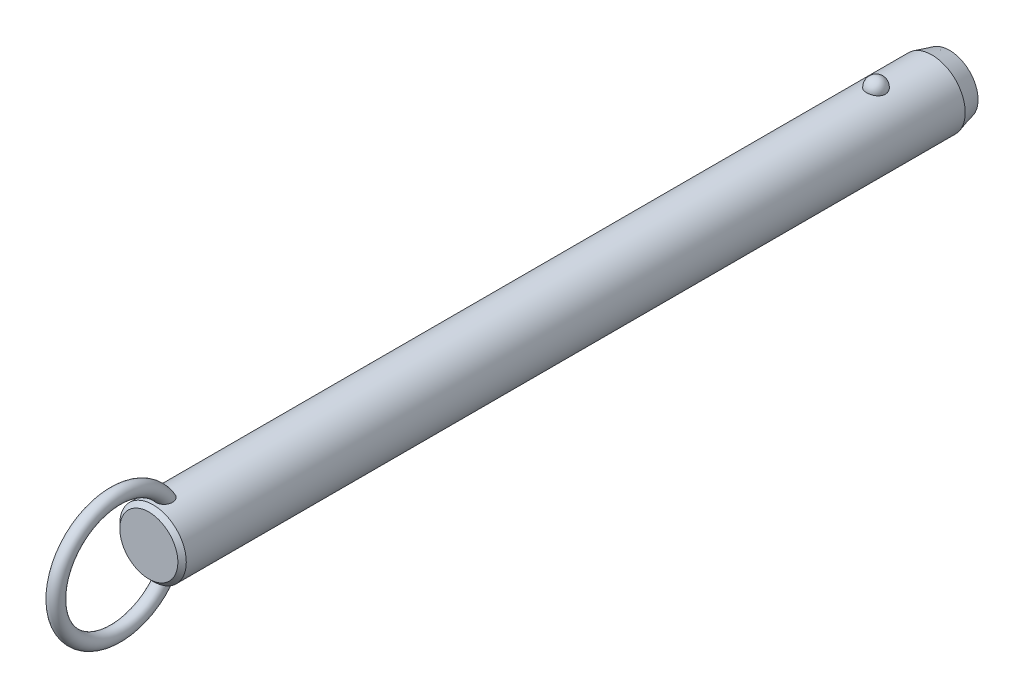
ISO-10303-21;
HEADER;
FILE_DESCRIPTION(('STEP AP214'),'2;1');
FILE_NAME('part.step','',(''),(''),'','','');
FILE_SCHEMA(('AUTOMOTIVE_DESIGN { 1 0 10303 214 1 1 1 1 }'));
ENDSEC;
DATA;
#1=APPLICATION_CONTEXT('core data for automotive mechanical design processes');
#2=APPLICATION_PROTOCOL_DEFINITION('international standard','automotive_design',2000,#1);
#3=PRODUCT_CONTEXT('',#1,'mechanical');
#4=PRODUCT('Part','Part','',(#3));
#5=PRODUCT_RELATED_PRODUCT_CATEGORY('part','',(#4));
#6=PRODUCT_DEFINITION_FORMATION('','',#4);
#7=PRODUCT_DEFINITION_CONTEXT('part definition',#1,'design');
#8=PRODUCT_DEFINITION('design','',#6,#7);
#9=PRODUCT_DEFINITION_SHAPE('','',#8);
#10=(LENGTH_UNIT() NAMED_UNIT(*) SI_UNIT(.MILLI.,.METRE.));
#11=(NAMED_UNIT(*) PLANE_ANGLE_UNIT() SI_UNIT($,.RADIAN.));
#12=(NAMED_UNIT(*) SI_UNIT($,.STERADIAN.) SOLID_ANGLE_UNIT());
#13=UNCERTAINTY_MEASURE_WITH_UNIT(LENGTH_MEASURE(1.E-05),#10,'distance_accuracy_value','');
#14=(GEOMETRIC_REPRESENTATION_CONTEXT(3) GLOBAL_UNCERTAINTY_ASSIGNED_CONTEXT((#13)) GLOBAL_UNIT_ASSIGNED_CONTEXT((#10,
#11,#12)) REPRESENTATION_CONTEXT('',''));
#15=CARTESIAN_POINT('',(0.,0.,0.));
#16=DIRECTION('',(0.,0.,1.));
#17=DIRECTION('',(1.,0.,0.));
#18=AXIS2_PLACEMENT_3D('',#15,#16,#17);
#19=CARTESIAN_POINT('',(0.,0.,195.6));
#20=DIRECTION('',(0.,0.,-1.));
#21=DIRECTION('',(-1.,0.,0.));
#22=AXIS2_PLACEMENT_3D('',#19,#20,#21);
#23=CYLINDRICAL_SURFACE('',#22,9.5);
#24=CARTESIAN_POINT('',(2.67259918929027,9.11631578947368,-2.70000000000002));
#25=CARTESIAN_POINT('',(2.6725968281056,9.11631786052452,-2.54909854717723));
#26=CARTESIAN_POINT('',(2.66030567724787,9.11994722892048,-2.39816735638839));
#27=CARTESIAN_POINT('',(2.6114347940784,9.13405924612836,-2.10058568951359));
#28=CARTESIAN_POINT('',(2.57484658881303,9.14454428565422,-1.95393672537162));
#29=CARTESIAN_POINT('',(2.47830875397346,9.17117631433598,-1.66916069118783));
#30=CARTESIAN_POINT('',(2.41836936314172,9.18732082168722,-1.53102991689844));
#31=CARTESIAN_POINT('',(2.27661331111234,9.22346780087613,-1.26705393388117));
#32=CARTESIAN_POINT('',(2.19479699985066,9.24347021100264,-1.14120852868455));
#33=CARTESIAN_POINT('',(2.01085282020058,9.28522401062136,-0.904632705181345));
#34=CARTESIAN_POINT('',(1.90862396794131,9.30698376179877,-0.793982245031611));
#35=CARTESIAN_POINT('',(1.6867437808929,9.34973971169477,-0.59160721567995));
#36=CARTESIAN_POINT('',(1.56709244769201,9.37073591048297,-0.499882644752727));
#37=CARTESIAN_POINT('',(1.31393976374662,9.40956370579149,-0.338167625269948));
#38=CARTESIAN_POINT('',(1.18048026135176,9.42740444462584,-0.268113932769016));
#39=CARTESIAN_POINT('',(0.903154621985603,9.45799906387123,-0.151390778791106));
#40=CARTESIAN_POINT('',(0.759289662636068,9.47075351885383,-0.104718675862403));
#41=CARTESIAN_POINT('',(0.468074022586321,9.48956256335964,-0.0367633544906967));
#42=CARTESIAN_POINT('',(0.320836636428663,9.49573643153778,-0.0150275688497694));
#43=CARTESIAN_POINT('',(0.0246714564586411,9.50112183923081,0.00396199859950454));
#44=CARTESIAN_POINT('',(-0.124256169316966,9.50033406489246,0.00121819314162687));
#45=CARTESIAN_POINT('',(-0.417264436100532,9.4919475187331,-0.0284441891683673));
#46=CARTESIAN_POINT('',(-0.56138413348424,9.48444885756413,-0.0550074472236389));
#47=CARTESIAN_POINT('',(-0.842986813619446,9.46357853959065,-0.131064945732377));
#48=CARTESIAN_POINT('',(-0.980469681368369,9.450206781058,-0.180559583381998));
#49=CARTESIAN_POINT('',(-1.24585005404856,9.41890822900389,-0.301476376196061));
#50=CARTESIAN_POINT('',(-1.37368611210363,9.40095498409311,-0.373026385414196));
#51=CARTESIAN_POINT('',(-1.61552738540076,9.36242964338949,-0.536025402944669));
#52=CARTESIAN_POINT('',(-1.72953116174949,9.34185727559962,-0.627476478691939));
#53=CARTESIAN_POINT('',(-1.9429225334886,9.29984568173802,-0.829844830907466));
#54=CARTESIAN_POINT('',(-2.04198021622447,9.27839736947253,-0.941108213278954));
#55=CARTESIAN_POINT('',(-2.22026460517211,9.23735994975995,-1.17883414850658));
#56=CARTESIAN_POINT('',(-2.29948985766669,9.21777097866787,-1.30529781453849));
#57=CARTESIAN_POINT('',(-2.43697287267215,9.18238994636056,-1.57158566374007));
#58=CARTESIAN_POINT('',(-2.49497068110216,9.16664569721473,-1.71155057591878));
#59=CARTESIAN_POINT('',(-2.5872073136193,9.14104303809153,-1.99961197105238));
#60=CARTESIAN_POINT('',(-2.62144683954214,9.13118445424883,-2.1477082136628));
#61=CARTESIAN_POINT('',(-2.66521466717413,9.11850622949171,-2.44715424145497));
#62=CARTESIAN_POINT('',(-2.67484831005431,9.11565658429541,-2.59848735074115));
#63=CARTESIAN_POINT('',(-2.66946735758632,9.11723375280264,-2.90067317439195));
#64=CARTESIAN_POINT('',(-2.65445345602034,9.12166036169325,-3.05152590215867));
#65=CARTESIAN_POINT('',(-2.60029711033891,9.13724422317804,-3.34766110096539));
#66=CARTESIAN_POINT('',(-2.56127978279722,9.14836656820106,-3.49296833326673));
#67=CARTESIAN_POINT('',(-2.46018844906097,9.17606676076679,-3.77477535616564));
#68=CARTESIAN_POINT('',(-2.39811349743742,9.1926448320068,-3.91127478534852));
#69=CARTESIAN_POINT('',(-2.25202303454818,9.22952198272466,-4.17244273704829));
#70=CARTESIAN_POINT('',(-2.16788714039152,9.24984129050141,-4.29704106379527));
#71=CARTESIAN_POINT('',(-1.9799408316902,9.29188255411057,-4.53013066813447));
#72=CARTESIAN_POINT('',(-1.87612963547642,9.31360456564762,-4.63862130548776));
#73=CARTESIAN_POINT('',(-1.65105429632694,9.35612959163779,-4.83690299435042));
#74=CARTESIAN_POINT('',(-1.52972405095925,9.37692871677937,-4.9266199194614));
#75=CARTESIAN_POINT('',(-1.27318250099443,9.41518970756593,-5.08429106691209));
#76=CARTESIAN_POINT('',(-1.13797219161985,9.432651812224,-5.15224684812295));
#77=CARTESIAN_POINT('',(-0.859280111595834,9.46208255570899,-5.26371827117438));
#78=CARTESIAN_POINT('',(-0.715925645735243,9.47411833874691,-5.30753421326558));
#79=CARTESIAN_POINT('',(-0.423550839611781,9.4916822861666,-5.37076321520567));
#80=CARTESIAN_POINT('',(-0.2745312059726,9.49721125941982,-5.39017930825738));
#81=CARTESIAN_POINT('',(0.0218446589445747,9.50110860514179,-5.40390587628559));
#82=CARTESIAN_POINT('',(0.16917707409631,9.49961381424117,-5.39869609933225));
#83=CARTESIAN_POINT('',(0.460808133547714,9.48993906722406,-5.36441955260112));
#84=CARTESIAN_POINT('',(0.605106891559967,9.48175936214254,-5.33535367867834));
#85=CARTESIAN_POINT('',(0.886027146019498,9.4596376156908,-5.25435587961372));
#86=CARTESIAN_POINT('',(1.02267710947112,9.44571881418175,-5.20251612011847));
#87=CARTESIAN_POINT('',(1.28523827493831,9.41358993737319,-5.07741549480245));
#88=CARTESIAN_POINT('',(1.41114877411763,9.39537958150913,-5.00415322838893));
#89=CARTESIAN_POINT('',(1.65085227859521,9.3562644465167,-4.83684599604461));
#90=CARTESIAN_POINT('',(1.76442346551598,9.33532178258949,-4.74249218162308));
#91=CARTESIAN_POINT('',(1.97425672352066,9.29321198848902,-4.53620389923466));
#92=CARTESIAN_POINT('',(2.07051582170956,9.27204482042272,-4.42426641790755));
#93=CARTESIAN_POINT('',(2.24490086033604,9.23139221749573,-4.18363183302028));
#94=CARTESIAN_POINT('',(2.32267019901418,9.21194380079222,-4.05466990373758));
#95=CARTESIAN_POINT('',(2.45584092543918,9.1773419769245,-3.78517836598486));
#96=CARTESIAN_POINT('',(2.5112497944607,9.16218713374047,-3.644652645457));
#97=CARTESIAN_POINT('',(2.59380876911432,9.13913522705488,-3.37104301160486));
#98=CARTESIAN_POINT('',(2.62330266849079,9.13064624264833,-3.23871053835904));
#99=CARTESIAN_POINT('',(2.66269870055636,9.11923566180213,-2.97092664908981));
#100=CARTESIAN_POINT('',(2.67260130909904,9.11631393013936,-2.83547530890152));
#101=CARTESIAN_POINT('',(2.67259918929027,9.11631578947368,-2.70000000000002));
#102=B_SPLINE_CURVE_WITH_KNOTS('',3,(#24,#25,#26,#27,#28,#29,#30,#31,#32,#33,#34,#35,#36,#37,
#38,#39,#40,#41,#42,#43,#44,#45,#46,#47,#48,#49,#50,#51,#52,#53,#54,#55,#56,#57,#58,#59,#60,#61,
#62,#63,#64,#65,#66,#67,#68,#69,#70,#71,#72,#73,#74,#75,#76,#77,#78,#79,#80,#81,#82,#83,#84,#85,
#86,#87,#88,#89,#90,#91,#92,#93,#94,#95,#96,#97,#98,#99,#100,#101),.UNSPECIFIED.,.T.,.F.,(4,2,2,
2,2,2,2,2,2,2,2,2,2,2,2,2,2,2,2,2,2,2,2,2,2,2,2,2,2,2,2,2,2,2,2,2,2,2,4),(0.,0.452217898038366,
0.904593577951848,1.35677112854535,1.80894144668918,2.26340676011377,2.71787203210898,
3.17099820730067,3.62407318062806,4.0687883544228,4.51345969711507,4.95160616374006,
5.38976021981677,5.83050358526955,6.27129275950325,6.72071308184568,7.17016633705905,
7.62495278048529,8.07972578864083,8.53254856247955,8.98535859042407,9.43582813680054,
9.88631615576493,10.3393155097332,10.7923328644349,11.2471065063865,11.7018475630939,
12.150795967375,12.599688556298,13.0398725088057,13.4800399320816,13.9184421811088,
14.3568730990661,14.802202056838,15.2476074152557,15.7010097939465,16.1542603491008,
16.5602594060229,16.966248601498),.UNSPECIFIED.);
#103=CARTESIAN_POINT('',(2.67259918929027,9.11631578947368,-2.70000000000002));
#104=VERTEX_POINT('',#103);
#105=EDGE_CURVE('E41',#104,#104,#102,.T.);
#106=ORIENTED_EDGE('',*,*,#105,.T.);
#107=EDGE_LOOP('',(#106));
#108=FACE_BOUND('',#107,.T.);
#109=CARTESIAN_POINT('',(0.,0.,203.92));
#110=DIRECTION('',(0.,0.,1.));
#111=DIRECTION('',(1.,0.,0.));
#112=AXIS2_PLACEMENT_3D('',#109,#110,#111);
#113=CIRCLE('',#112,9.5);
#114=CARTESIAN_POINT('',(9.5,0.,203.92));
#115=VERTEX_POINT('',#114);
#116=EDGE_CURVE('E10',#115,#115,#113,.F.);
#117=ORIENTED_EDGE('',*,*,#116,.T.);
#118=EDGE_LOOP('',(#117));
#119=FACE_BOUND('',#118,.T.);
#120=CARTESIAN_POINT('',(-0.697062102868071,-9.47439269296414,198.267808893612));
#121=CARTESIAN_POINT('',(-0.799579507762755,-9.46685146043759,198.307482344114));
#122=CARTESIAN_POINT('',(-0.898575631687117,-9.45788043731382,198.3559309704));
#123=CARTESIAN_POINT('',(-1.08670047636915,-9.43811593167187,198.468868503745));
#124=CARTESIAN_POINT('',(-1.17583204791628,-9.42732297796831,198.533352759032));
#125=CARTESIAN_POINT('',(-1.34179806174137,-9.40513672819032,198.676209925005));
#126=CARTESIAN_POINT('',(-1.41865133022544,-9.39374438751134,198.754561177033));
#127=CARTESIAN_POINT('',(-1.55860047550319,-9.37154196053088,198.922752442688));
#128=CARTESIAN_POINT('',(-1.62169476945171,-9.3607319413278,199.01259377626));
#129=CARTESIAN_POINT('',(-1.73527695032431,-9.34035749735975,199.204500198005));
#130=CARTESIAN_POINT('',(-1.78522266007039,-9.33085270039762,199.306891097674));
#131=CARTESIAN_POINT('',(-1.86924997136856,-9.3143834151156,199.518148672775));
#132=CARTESIAN_POINT('',(-1.90332570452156,-9.30741986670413,199.627017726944));
#133=CARTESIAN_POINT('',(-1.95893603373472,-9.29588482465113,199.860473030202));
#134=CARTESIAN_POINT('',(-1.97872420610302,-9.29165182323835,199.985489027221));
#135=CARTESIAN_POINT('',(-2.00062129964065,-9.28695978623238,200.237080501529));
#136=CARTESIAN_POINT('',(-2.00272284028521,-9.28650232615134,200.363656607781));
#137=CARTESIAN_POINT('',(-1.98958876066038,-9.28932750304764,200.636815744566));
#138=CARTESIAN_POINT('',(-1.97143366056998,-9.2932400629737,200.783251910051));
#139=CARTESIAN_POINT('',(-1.91479925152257,-9.30507151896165,201.072062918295));
#140=CARTESIAN_POINT('',(-1.87629122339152,-9.31299607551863,201.214431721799));
#141=CARTESIAN_POINT('',(-1.77225683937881,-9.33340232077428,201.515172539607));
#142=CARTESIAN_POINT('',(-1.70334898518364,-9.34641636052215,201.672369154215));
#143=CARTESIAN_POINT('',(-1.58111062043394,-9.36759153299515,201.897517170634));
#144=CARTESIAN_POINT('',(-1.53721459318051,-9.37492619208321,201.970796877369));
#145=CARTESIAN_POINT('',(-1.4430263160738,-9.38988566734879,202.11307405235));
#146=CARTESIAN_POINT('',(-1.39273721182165,-9.39751033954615,202.182073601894));
#147=CARTESIAN_POINT('',(-1.26775962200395,-9.41530678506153,202.336983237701));
#148=CARTESIAN_POINT('',(-1.19052326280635,-9.42548108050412,202.420871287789));
#149=CARTESIAN_POINT('',(-1.02420241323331,-9.44499825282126,202.576008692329));
#150=CARTESIAN_POINT('',(-0.93513986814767,-9.45434261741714,202.647280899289));
#151=CARTESIAN_POINT('',(-0.766610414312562,-9.46930670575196,202.758695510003));
#152=CARTESIAN_POINT('',(-0.689439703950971,-9.47529223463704,202.802235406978));
#153=CARTESIAN_POINT('',(-0.528942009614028,-9.48560294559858,202.87631336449));
#154=CARTESIAN_POINT('',(-0.445620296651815,-9.48992953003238,202.906862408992));
#155=CARTESIAN_POINT('',(-0.273901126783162,-9.49644161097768,202.952579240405));
#156=CARTESIAN_POINT('',(-0.18546574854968,-9.49860811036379,202.96761059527));
#157=CARTESIAN_POINT('',(-0.00734541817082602,-9.5004135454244,202.980149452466));
#158=CARTESIAN_POINT('',(0.0823387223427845,-9.50005405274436,202.977667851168));
#159=CARTESIAN_POINT('',(0.24767927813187,-9.49708301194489,202.956995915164));
#160=CARTESIAN_POINT('',(0.323620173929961,-9.49477609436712,202.940930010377));
#161=CARTESIAN_POINT('',(0.471981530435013,-9.48855917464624,202.897172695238));
#162=CARTESIAN_POINT('',(0.544400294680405,-9.48464840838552,202.869475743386));
#163=CARTESIAN_POINT('',(0.708947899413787,-9.47398336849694,202.79280266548));
#164=CARTESIAN_POINT('',(0.799149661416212,-9.46671310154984,202.739774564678));
#165=CARTESIAN_POINT('',(0.969783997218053,-9.45076225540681,202.619973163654));
#166=CARTESIAN_POINT('',(1.050194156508,-9.44207854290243,202.553169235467));
#167=CARTESIAN_POINT('',(1.23092343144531,-9.42051459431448,202.380759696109));
#168=CARTESIAN_POINT('',(1.32652499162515,-9.40733378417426,202.27026193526));
#169=CARTESIAN_POINT('',(1.49893121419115,-9.38140745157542,202.035561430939));
#170=CARTESIAN_POINT('',(1.5757161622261,-9.36866239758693,201.911344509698));
#171=CARTESIAN_POINT('',(1.71285426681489,-9.34457644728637,201.649389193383));
#172=CARTESIAN_POINT('',(1.77266365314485,-9.33328726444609,201.51136233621));
#173=CARTESIAN_POINT('',(1.87239208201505,-9.31379209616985,201.228051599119));
#174=CARTESIAN_POINT('',(1.91230158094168,-9.3055875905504,201.082764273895));
#175=CARTESIAN_POINT('',(1.97604189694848,-9.29228394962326,200.762028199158));
#176=CARTESIAN_POINT('',(1.9958743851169,-9.28797202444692,200.585724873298));
#177=CARTESIAN_POINT('',(2.0029570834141,-9.28645519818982,200.232414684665));
#178=CARTESIAN_POINT('',(1.99025930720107,-9.28923895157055,200.055409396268));
#179=CARTESIAN_POINT('',(1.93735479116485,-9.30038134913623,199.756338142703));
#180=CARTESIAN_POINT('',(1.90576827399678,-9.30697680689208,199.632667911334));
#181=CARTESIAN_POINT('',(1.8228748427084,-9.32356855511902,199.392329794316));
#182=CARTESIAN_POINT('',(1.77158213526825,-9.33356239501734,199.275656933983));
#183=CARTESIAN_POINT('',(1.64885744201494,-9.35602275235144,199.052706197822));
#184=CARTESIAN_POINT('',(1.57730995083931,-9.36850332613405,198.946492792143));
#185=CARTESIAN_POINT('',(1.41543264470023,-9.39431873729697,198.749553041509));
#186=CARTESIAN_POINT('',(1.32510883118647,-9.40765330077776,198.658821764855));
#187=CARTESIAN_POINT('',(1.13846223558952,-9.43195720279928,198.505033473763));
#188=CARTESIAN_POINT('',(1.04369890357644,-9.44302894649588,198.440094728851));
#189=CARTESIAN_POINT('',(0.843965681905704,-9.46296805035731,198.328038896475));
#190=CARTESIAN_POINT('',(0.739000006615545,-9.47183631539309,198.280914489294));
#191=CARTESIAN_POINT('',(0.528175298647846,-9.48586140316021,198.208117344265));
#192=CARTESIAN_POINT('',(0.422686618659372,-9.49119633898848,198.18140249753));
#193=CARTESIAN_POINT('',(0.208590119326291,-9.49831365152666,198.146013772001));
#194=CARTESIAN_POINT('',(0.0999817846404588,-9.500095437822,198.137342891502));
#195=CARTESIAN_POINT('',(-0.126104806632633,-9.49988861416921,198.138350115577));
#196=CARTESIAN_POINT('',(-0.243578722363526,-9.49757821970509,198.149594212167));
#197=CARTESIAN_POINT('',(-0.474390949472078,-9.48885165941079,198.193167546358));
#198=CARTESIAN_POINT('',(-0.587729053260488,-9.48243528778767,198.225497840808));
#199=CARTESIAN_POINT('',(-0.697062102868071,-9.47439269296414,198.267808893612));
#200=B_SPLINE_CURVE_WITH_KNOTS('',3,(#120,#121,#122,#123,#124,#125,#126,#127,#128,#129,#130,
#131,#132,#133,#134,#135,#136,#137,#138,#139,#140,#141,#142,#143,#144,#145,#146,#147,#148,#149,
#150,#151,#152,#153,#154,#155,#156,#157,#158,#159,#160,#161,#162,#163,#164,#165,#166,#167,#168,
#169,#170,#171,#172,#173,#174,#175,#176,#177,#178,#179,#180,#181,#182,#183,#184,#185,#186,#187,
#188,#189,#190,#191,#192,#193,#194,#195,#196,#197,#198,#199),.UNSPECIFIED.,.T.,.F.,(4,2,2,2,2,2,
2,2,2,2,2,2,2,2,2,2,2,2,2,2,2,2,2,2,2,2,2,2,2,2,2,2,2,2,2,2,2,2,2,4),(0.,0.330119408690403,
0.660143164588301,0.989655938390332,1.31920659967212,1.66074728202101,2.00241415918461,
2.38088696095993,2.75951768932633,3.20065679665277,3.64242004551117,4.15620996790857,
4.4131416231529,4.66994734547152,5.01228664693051,5.35399933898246,5.61943037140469,
5.88463652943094,6.15215502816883,6.4195070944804,6.65144391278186,6.88349136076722,
7.19641200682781,7.51003602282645,7.94779711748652,8.3860149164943,8.83699707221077,
9.28819530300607,9.81778662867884,10.34653170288,10.7284172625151,11.1100280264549,
11.4938603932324,11.8775702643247,12.2220189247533,12.5663259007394,12.8915939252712,
13.2169159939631,13.5689650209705,13.9210316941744),.UNSPECIFIED.);
#201=CARTESIAN_POINT('',(-0.697062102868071,-9.47439269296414,198.267808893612));
#202=VERTEX_POINT('',#201);
#203=EDGE_CURVE('E59',#202,#202,#200,.T.);
#204=ORIENTED_EDGE('',*,*,#203,.T.);
#205=EDGE_LOOP('',(#204));
#206=FACE_BOUND('',#205,.T.);
#207=CARTESIAN_POINT('',(-0.697062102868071,9.47439269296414,198.267808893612));
#208=CARTESIAN_POINT('',(-0.597792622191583,9.48169483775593,198.22939564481));
#209=CARTESIAN_POINT('',(-0.495106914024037,9.48766580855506,198.199168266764));
#210=CARTESIAN_POINT('',(-0.285876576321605,9.49627648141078,198.156032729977));
#211=CARTESIAN_POINT('',(-0.179324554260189,9.49890941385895,198.143159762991));
#212=CARTESIAN_POINT('',(0.0344157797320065,9.50053798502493,198.135166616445));
#213=CARTESIAN_POINT('',(0.141603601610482,9.49953613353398,198.140034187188));
#214=CARTESIAN_POINT('',(0.35356357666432,9.49401038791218,198.167365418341));
#215=CARTESIAN_POINT('',(0.458336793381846,9.48948807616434,198.18982117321));
#216=CARTESIAN_POINT('',(0.662493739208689,9.4774236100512,198.251671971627));
#217=CARTESIAN_POINT('',(0.761881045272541,9.46988348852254,198.291055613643));
#218=CARTESIAN_POINT('',(0.95260839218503,9.45260382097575,198.385634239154));
#219=CARTESIAN_POINT('',(1.04394806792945,9.44286417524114,198.440829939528));
#220=CARTESIAN_POINT('',(1.21712767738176,9.42211760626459,198.566066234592));
#221=CARTESIAN_POINT('',(1.29885671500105,9.41109835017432,198.636257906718));
#222=CARTESIAN_POINT('',(1.44978975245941,9.38903310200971,198.788980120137));
#223=CARTESIAN_POINT('',(1.51899278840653,9.37798710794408,198.871511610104));
#224=CARTESIAN_POINT('',(1.64602857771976,9.35654375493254,199.049776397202));
#225=CARTESIAN_POINT('',(1.70333052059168,9.34618688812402,199.145891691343));
#226=CARTESIAN_POINT('',(1.80259341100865,9.32755128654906,199.345897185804));
#227=CARTESIAN_POINT('',(1.84454942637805,9.31927322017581,199.449789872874));
#228=CARTESIAN_POINT('',(1.91637039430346,9.30478365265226,199.672213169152));
#229=CARTESIAN_POINT('',(1.944805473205,9.29882552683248,199.791219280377));
#230=CARTESIAN_POINT('',(1.98449865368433,9.29043398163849,200.032143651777));
#231=CARTESIAN_POINT('',(1.99574908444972,9.28800213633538,200.154063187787));
#232=CARTESIAN_POINT('',(2.00275141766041,9.28649645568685,200.416932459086));
#233=CARTESIAN_POINT('',(1.99588238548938,9.28799035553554,200.557952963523));
#234=CARTESIAN_POINT('',(1.96270559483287,9.29505517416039,200.837621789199));
#235=CARTESIAN_POINT('',(1.93637872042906,9.30063010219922,200.976267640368));
#236=CARTESIAN_POINT('',(1.85949176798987,9.31633564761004,201.272561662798));
#237=CARTESIAN_POINT('',(1.80549792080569,9.3270926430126,201.429290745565));
#238=CARTESIAN_POINT('',(1.67376869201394,9.3516306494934,201.732284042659));
#239=CARTESIAN_POINT('',(1.59603181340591,9.36541185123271,201.878547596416));
#240=CARTESIAN_POINT('',(1.4360277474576,9.39110706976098,202.125813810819));
#241=CARTESIAN_POINT('',(1.35831795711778,9.40278656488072,202.229791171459));
#242=CARTESIAN_POINT('',(1.18774483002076,9.42585025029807,202.424534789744));
#243=CARTESIAN_POINT('',(1.09490932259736,9.43723493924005,202.515324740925));
#244=CARTESIAN_POINT('',(0.92111037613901,9.45552616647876,202.65620334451));
#245=CARTESIAN_POINT('',(0.84373824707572,9.46281058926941,202.710656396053));
#246=CARTESIAN_POINT('',(0.681245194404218,9.47589120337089,202.806711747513));
#247=CARTESIAN_POINT('',(0.596135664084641,9.48168953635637,202.848332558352));
#248=CARTESIAN_POINT('',(0.433779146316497,9.49038144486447,202.910089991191));
#249=CARTESIAN_POINT('',(0.357459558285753,9.49359170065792,202.93260136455));
#250=CARTESIAN_POINT('',(0.202074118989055,9.49816761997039,202.964574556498));
#251=CARTESIAN_POINT('',(0.123010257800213,9.49953459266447,202.974045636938));
#252=CARTESIAN_POINT('',(-0.03573724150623,9.50026497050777,202.979114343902));
#253=CARTESIAN_POINT('',(-0.115421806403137,9.49962433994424,202.974684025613));
#254=CARTESIAN_POINT('',(-0.272823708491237,9.49640854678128,202.952296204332));
#255=CARTESIAN_POINT('',(-0.350540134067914,9.4938325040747,202.934332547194));
#256=CARTESIAN_POINT('',(-0.500580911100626,9.48709462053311,202.886802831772));
#257=CARTESIAN_POINT('',(-0.572979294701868,9.48296359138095,202.857461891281));
#258=CARTESIAN_POINT('',(-0.712864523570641,9.47347609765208,202.789008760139));
#259=CARTESIAN_POINT('',(-0.780349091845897,9.46811906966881,202.749892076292));
#260=CARTESIAN_POINT('',(-0.946309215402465,9.45329720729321,202.639432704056));
#261=CARTESIAN_POINT('',(-1.04090230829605,9.44321512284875,202.562329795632));
#262=CARTESIAN_POINT('',(-1.21661929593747,9.42219227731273,202.39409718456));
#263=CARTESIAN_POINT('',(-1.29770519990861,9.41124921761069,202.302929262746));
#264=CARTESIAN_POINT('',(-1.47319646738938,9.38563439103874,202.076162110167));
#265=CARTESIAN_POINT('',(-1.56208878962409,9.37102009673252,201.936289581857));
#266=CARTESIAN_POINT('',(-1.71623987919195,9.34401559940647,201.643950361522));
#267=CARTESIAN_POINT('',(-1.78147866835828,9.33162728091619,201.491473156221));
#268=CARTESIAN_POINT('',(-1.88853837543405,9.31055541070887,201.175647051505));
#269=CARTESIAN_POINT('',(-1.92998995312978,9.30193076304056,201.012168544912));
#270=CARTESIAN_POINT('',(-1.98590726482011,9.29015757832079,200.680526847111));
#271=CARTESIAN_POINT('',(-2.0004070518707,9.2870021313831,200.512369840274));
#272=CARTESIAN_POINT('',(-1.99964701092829,9.28716218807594,200.205080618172));
#273=CARTESIAN_POINT('',(-1.98908145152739,9.28945704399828,200.065936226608));
#274=CARTESIAN_POINT('',(-1.94566294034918,9.29865169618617,199.791153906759));
#275=CARTESIAN_POINT('',(-1.9128206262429,9.30554929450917,199.655514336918));
#276=CARTESIAN_POINT('',(-1.84582133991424,9.31898248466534,199.457802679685));
#277=CARTESIAN_POINT('',(-1.82038084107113,9.32400364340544,199.392583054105));
#278=CARTESIAN_POINT('',(-1.76350511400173,9.33492884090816,199.264903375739));
#279=CARTESIAN_POINT('',(-1.73207305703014,9.34083241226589,199.202441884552));
#280=CARTESIAN_POINT('',(-1.66324243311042,9.35333332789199,199.08094078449));
#281=CARTESIAN_POINT('',(-1.62584239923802,9.35993084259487,199.021902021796));
#282=CARTESIAN_POINT('',(-1.54527678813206,9.37356864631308,198.907987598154));
#283=CARTESIAN_POINT('',(-1.50211241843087,9.38060884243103,198.853111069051));
#284=CARTESIAN_POINT('',(-1.37681147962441,9.40004442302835,198.709961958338));
#285=CARTESIAN_POINT('',(-1.28916358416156,9.41261047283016,198.626429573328));
#286=CARTESIAN_POINT('',(-1.09996826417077,9.43658180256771,198.477236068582));
#287=CARTESIAN_POINT('',(-0.998461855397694,9.44799034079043,198.411523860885));
#288=CARTESIAN_POINT('',(-0.860188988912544,9.46103017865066,198.3394367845));
#289=CARTESIAN_POINT('',(-0.828141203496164,9.46389141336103,198.323851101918));
#290=CARTESIAN_POINT('',(-0.763210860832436,9.46934915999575,198.294473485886));
#291=CARTESIAN_POINT('',(-0.730328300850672,9.47194567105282,198.280681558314));
#292=CARTESIAN_POINT('',(-0.697062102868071,9.47439269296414,198.267808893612));
#293=B_SPLINE_CURVE_WITH_KNOTS('',3,(#207,#208,#209,#210,#211,#212,#213,#214,#215,#216,#217,
#218,#219,#220,#221,#222,#223,#224,#225,#226,#227,#228,#229,#230,#231,#232,#233,#234,#235,#236,
#237,#238,#239,#240,#241,#242,#243,#244,#245,#246,#247,#248,#249,#250,#251,#252,#253,#254,#255,
#256,#257,#258,#259,#260,#261,#262,#263,#264,#265,#266,#267,#268,#269,#270,#271,#272,#273,#274,
#275,#276,#277,#278,#279,#280,#281,#282,#283,#284,#285,#286,#287,#288,#289,#290,#291,#292),
.UNSPECIFIED.,.T.,.F.,(4,2,2,2,2,2,2,2,2,2,2,2,2,2,2,2,2,2,2,2,2,2,2,2,2,2,2,2,2,2,2,2,2,2,2,2,
2,2,2,2,2,2,4),(0.,0.319942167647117,0.640532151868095,0.96090081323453,1.2811255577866,
1.60113495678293,1.92115886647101,2.24457323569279,2.56801248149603,2.90371927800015,
3.23953387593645,3.60560313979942,3.97183576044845,4.39383693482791,4.8162532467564,
5.31257045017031,5.80891895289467,6.19868344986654,6.58773876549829,6.87145417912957,
7.15475838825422,7.39263751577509,7.63034760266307,7.86853584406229,8.10683246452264,
8.3406366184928,8.57454843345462,8.93983939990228,9.30614105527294,9.80266668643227,
10.2996107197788,10.8040753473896,11.3079021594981,11.7249776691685,12.1418541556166,
12.3521485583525,12.5623319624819,12.7725671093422,12.9827582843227,13.345827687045,
13.7078449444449,13.8150604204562,13.9222762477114),.UNSPECIFIED.);
#294=CARTESIAN_POINT('',(-0.697062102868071,9.47439269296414,198.267808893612));
#295=VERTEX_POINT('',#294);
#296=EDGE_CURVE('E67',#295,#295,#293,.T.);
#297=ORIENTED_EDGE('',*,*,#296,.T.);
#298=EDGE_LOOP('',(#297));
#299=FACE_BOUND('',#298,.T.);
#300=CARTESIAN_POINT('',(0.,0.,-18.6999999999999));
#301=DIRECTION('',(0.,0.,-1.));
#302=DIRECTION('',(-1.,0.,0.));
#303=AXIS2_PLACEMENT_3D('',#300,#301,#302);
#304=CIRCLE('',#303,9.5);
#305=CARTESIAN_POINT('',(-9.5,0.,-18.6999999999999));
#306=VERTEX_POINT('',#305);
#307=EDGE_CURVE('E56',#306,#306,#304,.F.);
#308=ORIENTED_EDGE('',*,*,#307,.T.);
#309=EDGE_LOOP('',(#308));
#310=FACE_BOUND('',#309,.T.);
#311=ADVANCED_FACE('F37',(#108,#119,#206,#299,#310),#23,.T.);
#312=CARTESIAN_POINT('',(0.,0.,-23.7));
#313=DIRECTION('',(0.,0.,-1.));
#314=DIRECTION('',(-1.,0.,0.));
#315=AXIS2_PLACEMENT_3D('',#312,#313,#314);
#316=PLANE('',#315);
#317=CARTESIAN_POINT('',(0.,0.,-23.7));
#318=DIRECTION('',(0.,0.,-1.));
#319=DIRECTION('',(-1.,0.,0.));
#320=AXIS2_PLACEMENT_3D('',#317,#318,#319);
#321=CIRCLE('',#320,8.16025403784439);
#322=CARTESIAN_POINT('',(-8.16025403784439,0.,-23.7));
#323=VERTEX_POINT('',#322);
#324=EDGE_CURVE('E66',#323,#323,#321,.T.);
#325=ORIENTED_EDGE('',*,*,#324,.T.);
#326=EDGE_LOOP('',(#325));
#327=FACE_BOUND('',#326,.T.);
#328=ADVANCED_FACE('F85',(#327),#316,.T.);
#329=CARTESIAN_POINT('',(0.,0.,-23.7));
#330=DIRECTION('',(0.,0.,1.));
#331=DIRECTION('',(1.,0.,0.));
#332=AXIS2_PLACEMENT_3D('',#329,#330,#331);
#333=CONICAL_SURFACE('',#332,8.16025403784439,0.261799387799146);
#334=ORIENTED_EDGE('',*,*,#307,.F.);
#335=EDGE_LOOP('',(#334));
#336=FACE_BOUND('',#335,.T.);
#337=ORIENTED_EDGE('',*,*,#324,.F.);
#338=EDGE_LOOP('',(#337));
#339=FACE_BOUND('',#338,.T.);
#340=ADVANCED_FACE('F83',(#336,#339),#333,.T.);
#341=CARTESIAN_POINT('',(0.,0.,205.12));
#342=DIRECTION('',(0.,0.,1.));
#343=DIRECTION('',(1.,0.,0.));
#344=AXIS2_PLACEMENT_3D('',#341,#342,#343);
#345=PLANE('',#344);
#346=CARTESIAN_POINT('',(0.,0.,205.12));
#347=DIRECTION('',(0.,0.,1.));
#348=DIRECTION('',(1.,0.,0.));
#349=AXIS2_PLACEMENT_3D('',#346,#347,#348);
#350=CIRCLE('',#349,8.29999999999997);
#351=CARTESIAN_POINT('',(8.29999999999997,0.,205.12));
#352=VERTEX_POINT('',#351);
#353=EDGE_CURVE('E50',#352,#352,#350,.T.);
#354=ORIENTED_EDGE('',*,*,#353,.T.);
#355=EDGE_LOOP('',(#354));
#356=FACE_BOUND('',#355,.T.);
#357=ADVANCED_FACE('F77',(#356),#345,.T.);
#358=CARTESIAN_POINT('',(0.,0.,214.65));
#359=DIRECTION('',(1.,0.,0.));
#360=DIRECTION('',(0.,0.,-1.));
#361=AXIS2_PLACEMENT_3D('',#358,#359,#360);
#362=TOROIDAL_SURFACE('',#361,17.05,2.);
#363=ORIENTED_EDGE('',*,*,#296,.F.);
#364=EDGE_LOOP('',(#363));
#365=FACE_BOUND('',#364,.T.);
#366=ORIENTED_EDGE('',*,*,#203,.F.);
#367=EDGE_LOOP('',(#366));
#368=FACE_BOUND('',#367,.T.);
#369=ADVANCED_FACE('F73',(#365,#368),#362,.T.);
#370=CARTESIAN_POINT('',(0.,0.,205.12));
#371=DIRECTION('',(0.,0.,-1.));
#372=DIRECTION('',(-1.,0.,0.));
#373=AXIS2_PLACEMENT_3D('',#370,#371,#372);
#374=CONICAL_SURFACE('',#373,8.29999999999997,0.785398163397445);
#375=ORIENTED_EDGE('',*,*,#116,.F.);
#376=EDGE_LOOP('',(#375));
#377=FACE_BOUND('',#376,.T.);
#378=ORIENTED_EDGE('',*,*,#353,.F.);
#379=EDGE_LOOP('',(#378));
#380=FACE_BOUND('',#379,.T.);
#381=ADVANCED_FACE('F39',(#377,#380),#374,.T.);
#382=CARTESIAN_POINT('',(0.,9.5,-2.70000000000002));
#383=DIRECTION('',(0.,1.,0.));
#384=DIRECTION('',(0.,0.,-1.));
#385=AXIS2_PLACEMENT_3D('',#382,#383,#384);
#386=SPHERICAL_SURFACE('',#385,2.7);
#387=ORIENTED_EDGE('',*,*,#105,.F.);
#388=EDGE_LOOP('',(#387));
#389=FACE_BOUND('',#388,.T.);
#390=ADVANCED_FACE('F79',(#389),#386,.T.);
#391=CLOSED_SHELL('',(#311,#328,#340,#357,#369,#381,#390));
#392=MANIFOLD_SOLID_BREP('B2',#391);
#393=ADVANCED_BREP_SHAPE_REPRESENTATION('',(#18,#392),#14);
#394=SHAPE_DEFINITION_REPRESENTATION(#9,#393);
ENDSEC;
END-ISO-10303-21;
